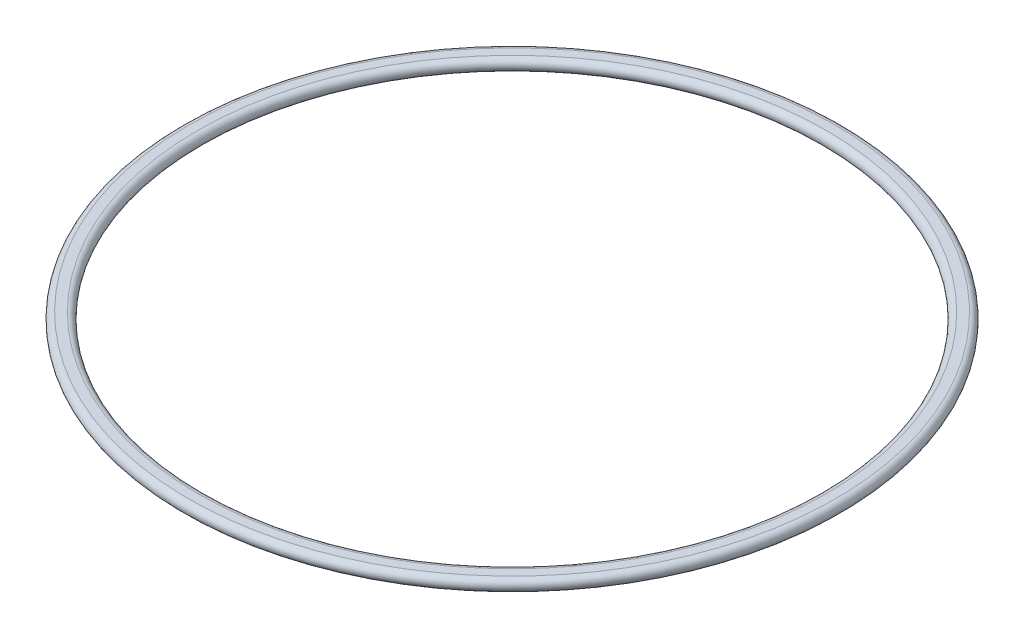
from build123d import *


with BuildPart() as part:
    # Esquisse1 → Base (revolve)
    with BuildSketch(Plane.XY, mode=Mode.PRIVATE) as base_sk:
        with BuildLine():
            Line((33.65075, -0.65075), (34.61975, -0.65075))
            ThreePointArc((34.61975, -0.65075), (35.2705, 0), (34.61975, 0.65075))
            Line((34.61975, 0.65075), (33.65075, 0.65075))
            ThreePointArc((33.65075, 0.65075), (33, 0), (33.65075, -0.65075))
        make_face()
    revolve(base_sk.sketch.rotate(Axis((0, 1.9, 0), (0, -1, 0)), 180), axis=Axis((0, 1.9, 0), (0, -1, 0)))


solid = part.part
